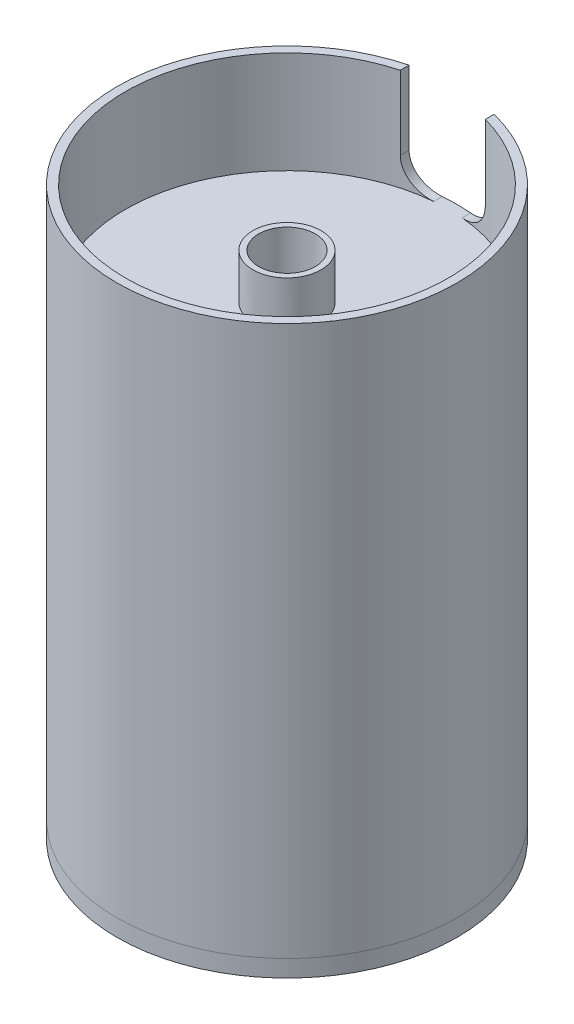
ISO-10303-21;
HEADER;
FILE_DESCRIPTION(('STEP AP214'),'2;1');
FILE_NAME('part.step','',(''),(''),'','','');
FILE_SCHEMA(('AUTOMOTIVE_DESIGN { 1 0 10303 214 1 1 1 1 }'));
ENDSEC;
DATA;
#1=APPLICATION_CONTEXT('core data for automotive mechanical design processes');
#2=APPLICATION_PROTOCOL_DEFINITION('international standard','automotive_design',2000,#1);
#3=PRODUCT_CONTEXT('',#1,'mechanical');
#4=PRODUCT('Part','Part','',(#3));
#5=PRODUCT_RELATED_PRODUCT_CATEGORY('part','',(#4));
#6=PRODUCT_DEFINITION_FORMATION('','',#4);
#7=PRODUCT_DEFINITION_CONTEXT('part definition',#1,'design');
#8=PRODUCT_DEFINITION('design','',#6,#7);
#9=PRODUCT_DEFINITION_SHAPE('','',#8);
#10=(LENGTH_UNIT() NAMED_UNIT(*) SI_UNIT(.MILLI.,.METRE.));
#11=(NAMED_UNIT(*) PLANE_ANGLE_UNIT() SI_UNIT($,.RADIAN.));
#12=(NAMED_UNIT(*) SI_UNIT($,.STERADIAN.) SOLID_ANGLE_UNIT());
#13=UNCERTAINTY_MEASURE_WITH_UNIT(LENGTH_MEASURE(1.E-05),#10,'distance_accuracy_value','');
#14=(GEOMETRIC_REPRESENTATION_CONTEXT(3) GLOBAL_UNCERTAINTY_ASSIGNED_CONTEXT((#13)) GLOBAL_UNIT_ASSIGNED_CONTEXT((#10,
#11,#12)) REPRESENTATION_CONTEXT('',''));
#15=CARTESIAN_POINT('',(0.,0.,0.));
#16=DIRECTION('',(0.,0.,1.));
#17=DIRECTION('',(1.,0.,0.));
#18=AXIS2_PLACEMENT_3D('',#15,#16,#17);
#19=CARTESIAN_POINT('',(0.,-93.,0.));
#20=DIRECTION('',(0.,-1.,0.));
#21=DIRECTION('',(1.,0.,0.));
#22=AXIS2_PLACEMENT_3D('',#19,#20,#21);
#23=CYLINDRICAL_SURFACE('',#22,18.);
#24=CARTESIAN_POINT('',(0.,-93.,0.));
#25=DIRECTION('',(0.,-1.,0.));
#26=DIRECTION('',(1.,0.,0.));
#27=AXIS2_PLACEMENT_3D('',#24,#25,#26);
#28=CIRCLE('',#27,18.);
#29=CARTESIAN_POINT('',(18.0000000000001,-93.,0.));
#30=VERTEX_POINT('',#29);
#31=EDGE_CURVE('E11',#30,#30,#28,.T.);
#32=ORIENTED_EDGE('',*,*,#31,.T.);
#33=EDGE_LOOP('',(#32));
#34=FACE_BOUND('',#33,.T.);
#35=CARTESIAN_POINT('',(1.00723583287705E-13,-94.,0.));
#36=DIRECTION('',(0.,-1.,0.));
#37=DIRECTION('',(1.,0.,0.));
#38=AXIS2_PLACEMENT_3D('',#35,#36,#37);
#39=CIRCLE('',#38,18.);
#40=CARTESIAN_POINT('',(18.0000000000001,-94.,0.));
#41=VERTEX_POINT('',#40);
#42=EDGE_CURVE('E46',#41,#41,#39,.T.);
#43=ORIENTED_EDGE('',*,*,#42,.F.);
#44=EDGE_LOOP('',(#43));
#45=FACE_BOUND('',#44,.T.);
#46=ADVANCED_FACE('F43',(#34,#45),#23,.T.);
#47=CARTESIAN_POINT('',(0.,-93.,0.));
#48=DIRECTION('',(0.,-1.,0.));
#49=DIRECTION('',(1.,0.,0.));
#50=AXIS2_PLACEMENT_3D('',#47,#48,#49);
#51=PLANE('',#50);
#52=ORIENTED_EDGE('',*,*,#31,.F.);
#53=EDGE_LOOP('',(#52));
#54=FACE_BOUND('',#53,.T.);
#55=ADVANCED_FACE('F58',(#54),#51,.F.);
#56=CARTESIAN_POINT('',(1.00723583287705E-13,-94.,0.));
#57=DIRECTION('',(0.,-1.,0.));
#58=DIRECTION('',(1.,0.,0.));
#59=AXIS2_PLACEMENT_3D('',#56,#57,#58);
#60=PLANE('',#59);
#61=ORIENTED_EDGE('',*,*,#42,.T.);
#62=EDGE_LOOP('',(#61));
#63=FACE_BOUND('',#62,.T.);
#64=ADVANCED_FACE('F55',(#63),#60,.T.);
#65=CLOSED_SHELL('',(#46,#55,#64));
#66=MANIFOLD_SOLID_BREP('B2',#65);
#67=CARTESIAN_POINT('',(0.,-91.,0.));
#68=DIRECTION('',(0.,1.,0.));
#69=DIRECTION('',(-1.,0.,0.));
#70=AXIS2_PLACEMENT_3D('',#67,#68,#69);
#71=PLANE('',#70);
#72=CARTESIAN_POINT('',(0.,-91.,0.));
#73=DIRECTION('',(0.,1.,0.));
#74=DIRECTION('',(-1.,0.,0.));
#75=AXIS2_PLACEMENT_3D('',#72,#73,#74);
#76=CIRCLE('',#75,25.);
#77=CARTESIAN_POINT('',(-24.9999999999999,-91.,0.));
#78=VERTEX_POINT('',#77);
#79=EDGE_CURVE('E42',#78,#78,#76,.T.);
#80=ORIENTED_EDGE('',*,*,#79,.T.);
#81=EDGE_LOOP('',(#80));
#82=FACE_BOUND('',#81,.T.);
#83=CARTESIAN_POINT('',(0.,-91.,0.));
#84=DIRECTION('',(0.,1.,0.));
#85=DIRECTION('',(-1.,0.,0.));
#86=AXIS2_PLACEMENT_3D('',#83,#84,#85);
#87=CIRCLE('',#86,18.);
#88=CARTESIAN_POINT('',(-17.9999999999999,-91.,0.));
#89=VERTEX_POINT('',#88);
#90=EDGE_CURVE('E102',#89,#89,#87,.T.);
#91=ORIENTED_EDGE('',*,*,#90,.F.);
#92=EDGE_LOOP('',(#91));
#93=FACE_BOUND('',#92,.T.);
#94=ADVANCED_FACE('F91',(#82,#93),#71,.T.);
#95=CARTESIAN_POINT('',(1.00723583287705E-13,-94.,0.));
#96=DIRECTION('',(0.,1.,0.));
#97=DIRECTION('',(-1.,0.,0.));
#98=AXIS2_PLACEMENT_3D('',#95,#96,#97);
#99=PLANE('',#98);
#100=CARTESIAN_POINT('',(1.00723583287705E-13,-94.,0.));
#101=DIRECTION('',(0.,1.,0.));
#102=DIRECTION('',(-1.,0.,0.));
#103=AXIS2_PLACEMENT_3D('',#100,#101,#102);
#104=CIRCLE('',#103,25.);
#105=CARTESIAN_POINT('',(-24.9999999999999,-94.,0.));
#106=VERTEX_POINT('',#105);
#107=EDGE_CURVE('E95',#106,#106,#104,.T.);
#108=ORIENTED_EDGE('',*,*,#107,.F.);
#109=EDGE_LOOP('',(#108));
#110=FACE_BOUND('',#109,.T.);
#111=CARTESIAN_POINT('',(1.00723583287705E-13,-94.,0.));
#112=DIRECTION('',(0.,1.,0.));
#113=DIRECTION('',(-1.,0.,0.));
#114=AXIS2_PLACEMENT_3D('',#111,#112,#113);
#115=CIRCLE('',#114,18.);
#116=CARTESIAN_POINT('',(-17.9999999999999,-94.,0.));
#117=VERTEX_POINT('',#116);
#118=EDGE_CURVE('E104',#117,#117,#115,.T.);
#119=ORIENTED_EDGE('',*,*,#118,.T.);
#120=EDGE_LOOP('',(#119));
#121=FACE_BOUND('',#120,.T.);
#122=ADVANCED_FACE('F114',(#110,#121),#99,.F.);
#123=CARTESIAN_POINT('',(0.,-91.,0.));
#124=DIRECTION('',(0.,-1.,0.));
#125=DIRECTION('',(1.,0.,0.));
#126=AXIS2_PLACEMENT_3D('',#123,#124,#125);
#127=CYLINDRICAL_SURFACE('',#126,25.);
#128=ORIENTED_EDGE('',*,*,#79,.F.);
#129=EDGE_LOOP('',(#128));
#130=FACE_BOUND('',#129,.T.);
#131=ORIENTED_EDGE('',*,*,#107,.T.);
#132=EDGE_LOOP('',(#131));
#133=FACE_BOUND('',#132,.T.);
#134=ADVANCED_FACE('F93',(#130,#133),#127,.T.);
#135=CARTESIAN_POINT('',(0.,-91.,0.));
#136=DIRECTION('',(0.,-1.,0.));
#137=DIRECTION('',(1.,0.,0.));
#138=AXIS2_PLACEMENT_3D('',#135,#136,#137);
#139=CYLINDRICAL_SURFACE('',#138,18.);
#140=ORIENTED_EDGE('',*,*,#90,.T.);
#141=EDGE_LOOP('',(#140));
#142=FACE_BOUND('',#141,.T.);
#143=ORIENTED_EDGE('',*,*,#118,.F.);
#144=EDGE_LOOP('',(#143));
#145=FACE_BOUND('',#144,.T.);
#146=ADVANCED_FACE('F110',(#142,#145),#139,.F.);
#147=CLOSED_SHELL('',(#94,#122,#134,#146));
#148=MANIFOLD_SOLID_BREP('B6',#147);
#149=CARTESIAN_POINT('',(0.,-94.,0.));
#150=DIRECTION('',(0.,1.,0.));
#151=DIRECTION('',(-1.,0.,0.));
#152=AXIS2_PLACEMENT_3D('',#149,#150,#151);
#153=PLANE('',#152);
#154=CARTESIAN_POINT('',(0.,-94.,0.));
#155=DIRECTION('',(0.,1.,0.));
#156=DIRECTION('',(-1.,0.,0.));
#157=AXIS2_PLACEMENT_3D('',#154,#155,#156);
#158=CIRCLE('',#157,28.535323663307);
#159=CARTESIAN_POINT('',(-28.535323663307,-94.,0.));
#160=VERTEX_POINT('',#159);
#161=EDGE_CURVE('E90',#160,#160,#158,.T.);
#162=ORIENTED_EDGE('',*,*,#161,.T.);
#163=EDGE_LOOP('',(#162));
#164=FACE_BOUND('',#163,.T.);
#165=CARTESIAN_POINT('',(0.,-94.,0.));
#166=DIRECTION('',(0.,1.,0.));
#167=DIRECTION('',(-1.,0.,0.));
#168=AXIS2_PLACEMENT_3D('',#165,#166,#167);
#169=CIRCLE('',#168,20.);
#170=CARTESIAN_POINT('',(-20.,-94.,0.));
#171=VERTEX_POINT('',#170);
#172=EDGE_CURVE('E183',#171,#171,#169,.T.);
#173=ORIENTED_EDGE('',*,*,#172,.F.);
#174=EDGE_LOOP('',(#173));
#175=FACE_BOUND('',#174,.T.);
#176=ADVANCED_FACE('F161',(#164,#175),#153,.T.);
#177=CARTESIAN_POINT('',(0.,-89.1404723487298,0.));
#178=DIRECTION('',(0.,1.,0.));
#179=DIRECTION('',(-1.,0.,0.));
#180=AXIS2_PLACEMENT_3D('',#177,#178,#179);
#181=CYLINDRICAL_SURFACE('',#180,28.535323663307);
#182=CARTESIAN_POINT('',(0.,-97.,0.));
#183=DIRECTION('',(0.,1.,0.));
#184=DIRECTION('',(-1.,0.,0.));
#185=AXIS2_PLACEMENT_3D('',#182,#183,#184);
#186=CIRCLE('',#185,28.535323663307);
#187=CARTESIAN_POINT('',(-28.535323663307,-97.,0.));
#188=VERTEX_POINT('',#187);
#189=EDGE_CURVE('E167',#188,#188,#186,.T.);
#190=ORIENTED_EDGE('',*,*,#189,.T.);
#191=EDGE_LOOP('',(#190));
#192=FACE_BOUND('',#191,.T.);
#193=ORIENTED_EDGE('',*,*,#161,.F.);
#194=EDGE_LOOP('',(#193));
#195=FACE_BOUND('',#194,.T.);
#196=ADVANCED_FACE('F191',(#192,#195),#181,.T.);
#197=CARTESIAN_POINT('',(0.,-97.,0.));
#198=DIRECTION('',(0.,1.,0.));
#199=DIRECTION('',(-1.,0.,0.));
#200=AXIS2_PLACEMENT_3D('',#197,#198,#199);
#201=PLANE('',#200);
#202=CARTESIAN_POINT('',(0.,-97.,0.));
#203=DIRECTION('',(0.,1.,0.));
#204=DIRECTION('',(-1.,0.,0.));
#205=AXIS2_PLACEMENT_3D('',#202,#203,#204);
#206=CIRCLE('',#205,30.);
#207=CARTESIAN_POINT('',(-30.,-97.,0.));
#208=VERTEX_POINT('',#207);
#209=EDGE_CURVE('E171',#208,#208,#206,.T.);
#210=ORIENTED_EDGE('',*,*,#209,.T.);
#211=EDGE_LOOP('',(#210));
#212=FACE_BOUND('',#211,.T.);
#213=ORIENTED_EDGE('',*,*,#189,.F.);
#214=EDGE_LOOP('',(#213));
#215=FACE_BOUND('',#214,.T.);
#216=ADVANCED_FACE('F195',(#212,#215),#201,.T.);
#217=CARTESIAN_POINT('',(0.,-89.1404723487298,0.));
#218=DIRECTION('',(0.,1.,0.));
#219=DIRECTION('',(-1.,0.,0.));
#220=AXIS2_PLACEMENT_3D('',#217,#218,#219);
#221=CYLINDRICAL_SURFACE('',#220,30.);
#222=ORIENTED_EDGE('',*,*,#209,.F.);
#223=EDGE_LOOP('',(#222));
#224=FACE_BOUND('',#223,.T.);
#225=CARTESIAN_POINT('',(0.,-100.,0.));
#226=DIRECTION('',(0.,1.,0.));
#227=DIRECTION('',(-1.,0.,0.));
#228=AXIS2_PLACEMENT_3D('',#225,#226,#227);
#229=CIRCLE('',#228,30.);
#230=CARTESIAN_POINT('',(-30.,-100.,0.));
#231=VERTEX_POINT('',#230);
#232=EDGE_CURVE('E175',#231,#231,#229,.T.);
#233=ORIENTED_EDGE('',*,*,#232,.T.);
#234=EDGE_LOOP('',(#233));
#235=FACE_BOUND('',#234,.T.);
#236=ADVANCED_FACE('F199',(#224,#235),#221,.T.);
#237=CARTESIAN_POINT('',(0.,-100.,0.));
#238=DIRECTION('',(0.,1.,0.));
#239=DIRECTION('',(-1.,0.,0.));
#240=AXIS2_PLACEMENT_3D('',#237,#238,#239);
#241=PLANE('',#240);
#242=ORIENTED_EDGE('',*,*,#232,.F.);
#243=EDGE_LOOP('',(#242));
#244=FACE_BOUND('',#243,.T.);
#245=CARTESIAN_POINT('',(0.,-100.,0.));
#246=DIRECTION('',(0.,1.,0.));
#247=DIRECTION('',(-1.,0.,0.));
#248=AXIS2_PLACEMENT_3D('',#245,#246,#247);
#249=CIRCLE('',#248,26.);
#250=CARTESIAN_POINT('',(-26.,-100.,0.));
#251=VERTEX_POINT('',#250);
#252=EDGE_CURVE('E180',#251,#251,#249,.T.);
#253=ORIENTED_EDGE('',*,*,#252,.T.);
#254=EDGE_LOOP('',(#253));
#255=FACE_BOUND('',#254,.T.);
#256=ADVANCED_FACE('F206',(#244,#255),#241,.F.);
#257=CARTESIAN_POINT('',(0.,-100.,0.));
#258=DIRECTION('',(0.,-1.,0.));
#259=DIRECTION('',(1.,0.,0.));
#260=AXIS2_PLACEMENT_3D('',#257,#258,#259);
#261=CONICAL_SURFACE('',#260,26.,0.785398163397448);
#262=ORIENTED_EDGE('',*,*,#172,.T.);
#263=EDGE_LOOP('',(#262));
#264=FACE_BOUND('',#263,.T.);
#265=ORIENTED_EDGE('',*,*,#252,.F.);
#266=EDGE_LOOP('',(#265));
#267=FACE_BOUND('',#266,.T.);
#268=ADVANCED_FACE('F187',(#264,#267),#261,.F.);
#269=CLOSED_SHELL('',(#176,#196,#216,#236,#256,#268));
#270=MANIFOLD_SOLID_BREP('B37',#269);
#271=CARTESIAN_POINT('',(0.,-97.,0.));
#272=DIRECTION('',(0.,1.,0.));
#273=DIRECTION('',(0.,0.,1.));
#274=AXIS2_PLACEMENT_3D('',#271,#272,#273);
#275=CYLINDRICAL_SURFACE('',#274,28.5);
#276=CARTESIAN_POINT('',(0.,-97.,0.));
#277=DIRECTION('',(0.,1.,0.));
#278=DIRECTION('',(0.,0.,1.));
#279=AXIS2_PLACEMENT_3D('',#276,#277,#278);
#280=CIRCLE('',#279,28.5);
#281=CARTESIAN_POINT('',(0.,-97.,28.5));
#282=VERTEX_POINT('',#281);
#283=EDGE_CURVE('E414',#282,#282,#280,.T.);
#284=CARTESIAN_POINT('',(0.,-21.,0.));
#285=DIRECTION('',(0.,1.,0.));
#286=DIRECTION('',(0.,0.,1.));
#287=AXIS2_PLACEMENT_3D('',#284,#285,#286);
#288=CIRCLE('',#287,28.5);
#289=CARTESIAN_POINT('',(0.,-21.,28.5));
#290=VERTEX_POINT('',#289);
#291=EDGE_CURVE('E265',#290,#290,#288,.F.);
#292=CARTESIAN_POINT('',(0.,-97.,28.5));
#293=CARTESIAN_POINT('',(0.,-96.2083333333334,28.5));
#294=CARTESIAN_POINT('',(0.,-95.4166666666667,28.5));
#295=CARTESIAN_POINT('',(0.,-93.8333333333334,28.5));
#296=CARTESIAN_POINT('',(0.,-93.0416666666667,28.5));
#297=CARTESIAN_POINT('',(0.,-91.4583333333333,28.5));
#298=CARTESIAN_POINT('',(0.,-90.6666666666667,28.5));
#299=CARTESIAN_POINT('',(0.,-89.0833333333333,28.5));
#300=CARTESIAN_POINT('',(0.,-88.2916666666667,28.5));
#301=CARTESIAN_POINT('',(0.,-86.7083333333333,28.5));
#302=CARTESIAN_POINT('',(0.,-85.9166666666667,28.5));
#303=CARTESIAN_POINT('',(0.,-84.3333333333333,28.5));
#304=CARTESIAN_POINT('',(0.,-83.5416666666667,28.5));
#305=CARTESIAN_POINT('',(0.,-81.9583333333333,28.5));
#306=CARTESIAN_POINT('',(0.,-81.1666666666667,28.5));
#307=CARTESIAN_POINT('',(0.,-79.5833333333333,28.5));
#308=CARTESIAN_POINT('',(0.,-78.7916666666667,28.5));
#309=CARTESIAN_POINT('',(0.,-77.2083333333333,28.5));
#310=CARTESIAN_POINT('',(0.,-76.4166666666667,28.5));
#311=CARTESIAN_POINT('',(0.,-74.8333333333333,28.5));
#312=CARTESIAN_POINT('',(0.,-74.0416666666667,28.5));
#313=CARTESIAN_POINT('',(0.,-72.4583333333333,28.5));
#314=CARTESIAN_POINT('',(0.,-71.6666666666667,28.5));
#315=CARTESIAN_POINT('',(0.,-70.0833333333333,28.5));
#316=CARTESIAN_POINT('',(0.,-69.2916666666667,28.5));
#317=CARTESIAN_POINT('',(0.,-67.7083333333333,28.5));
#318=CARTESIAN_POINT('',(0.,-66.9166666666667,28.5));
#319=CARTESIAN_POINT('',(0.,-65.3333333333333,28.5));
#320=CARTESIAN_POINT('',(0.,-64.5416666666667,28.5));
#321=CARTESIAN_POINT('',(0.,-62.9583333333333,28.5));
#322=CARTESIAN_POINT('',(0.,-62.1666666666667,28.5));
#323=CARTESIAN_POINT('',(0.,-60.5833333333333,28.5));
#324=CARTESIAN_POINT('',(0.,-59.7916666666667,28.5));
#325=CARTESIAN_POINT('',(0.,-58.2083333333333,28.5));
#326=CARTESIAN_POINT('',(0.,-57.4166666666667,28.5));
#327=CARTESIAN_POINT('',(0.,-55.8333333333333,28.5));
#328=CARTESIAN_POINT('',(0.,-55.0416666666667,28.5));
#329=CARTESIAN_POINT('',(0.,-53.4583333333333,28.5));
#330=CARTESIAN_POINT('',(0.,-52.6666666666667,28.5));
#331=CARTESIAN_POINT('',(0.,-51.0833333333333,28.5));
#332=CARTESIAN_POINT('',(0.,-50.2916666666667,28.5));
#333=CARTESIAN_POINT('',(0.,-48.7083333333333,28.5));
#334=CARTESIAN_POINT('',(0.,-47.9166666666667,28.5));
#335=CARTESIAN_POINT('',(0.,-46.3333333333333,28.5));
#336=CARTESIAN_POINT('',(0.,-45.5416666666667,28.5));
#337=CARTESIAN_POINT('',(0.,-43.9583333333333,28.5));
#338=CARTESIAN_POINT('',(0.,-43.1666666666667,28.5));
#339=CARTESIAN_POINT('',(0.,-41.5833333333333,28.5));
#340=CARTESIAN_POINT('',(0.,-40.7916666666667,28.5));
#341=CARTESIAN_POINT('',(0.,-39.2083333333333,28.5));
#342=CARTESIAN_POINT('',(0.,-38.4166666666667,28.5));
#343=CARTESIAN_POINT('',(0.,-36.8333333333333,28.5));
#344=CARTESIAN_POINT('',(0.,-36.0416666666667,28.5));
#345=CARTESIAN_POINT('',(0.,-34.4583333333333,28.5));
#346=CARTESIAN_POINT('',(0.,-33.6666666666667,28.5));
#347=CARTESIAN_POINT('',(0.,-32.0833333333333,28.5));
#348=CARTESIAN_POINT('',(0.,-31.2916666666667,28.5));
#349=CARTESIAN_POINT('',(0.,-29.7083333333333,28.5));
#350=CARTESIAN_POINT('',(0.,-28.9166666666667,28.5));
#351=CARTESIAN_POINT('',(0.,-27.3333333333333,28.5));
#352=CARTESIAN_POINT('',(0.,-26.5416666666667,28.5));
#353=CARTESIAN_POINT('',(0.,-24.9583333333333,28.5));
#354=CARTESIAN_POINT('',(0.,-24.1666666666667,28.5));
#355=CARTESIAN_POINT('',(0.,-22.5833333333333,28.5));
#356=CARTESIAN_POINT('',(0.,-21.7916666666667,28.5));
#357=CARTESIAN_POINT('',(0.,-21.,28.5));
#358=B_SPLINE_CURVE_WITH_KNOTS('',3,(#292,#293,#294,#295,#296,#297,#298,#299,#300,#301,#302,
#303,#304,#305,#306,#307,#308,#309,#310,#311,#312,#313,#314,#315,#316,#317,#318,#319,#320,#321,
#322,#323,#324,#325,#326,#327,#328,#329,#330,#331,#332,#333,#334,#335,#336,#337,#338,#339,#340,
#341,#342,#343,#344,#345,#346,#347,#348,#349,#350,#351,#352,#353,#354,#355,#356,#357),
.UNSPECIFIED.,.F.,.F.,(4,2,2,2,2,2,2,2,2,2,2,2,2,2,2,2,2,2,2,2,2,2,2,2,2,2,2,2,2,2,2,2,4),(0.,
2.375,4.75,7.12500000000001,9.50000000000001,11.875,14.25,16.625,19.,21.375,23.75,26.125,28.5,
30.875,33.25,35.625,38.,40.375,42.75,45.125,47.5,49.875,52.25,54.625,57.,59.375,61.75,64.125,
66.5,68.875,71.25,73.625,76.),.UNSPECIFIED.);
#359=EDGE_CURVE('BSEAM256',#282,#290,#358,.T.);
#360=ORIENTED_EDGE('',*,*,#283,.F.);
#361=ORIENTED_EDGE('',*,*,#291,.F.);
#362=ORIENTED_EDGE('',*,*,#359,.T.);
#363=ORIENTED_EDGE('',*,*,#359,.F.);
#364=EDGE_LOOP('',(#360,#362,#361,#363));
#365=FACE_BOUND('',#364,.T.);
#366=ADVANCED_FACE('F256',(#365),#275,.F.);
#367=CARTESIAN_POINT('',(7.5,-13.,-40.));
#368=DIRECTION('',(1.,0.,0.));
#369=DIRECTION('',(0.,1.,0.));
#370=AXIS2_PLACEMENT_3D('',#367,#368,#369);
#371=PLANE('',#370);
#372=DIRECTION('',(0.,1.,0.));
#373=VECTOR('',#372,1.);
#374=CARTESIAN_POINT('',(7.50000000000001,-97.,-27.495454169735));
#375=LINE('',#374,#373);
#376=CARTESIAN_POINT('',(7.5,0.,-27.495454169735));
#377=VERTEX_POINT('',#376);
#378=CARTESIAN_POINT('',(7.5,-13.,-27.495454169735));
#379=VERTEX_POINT('',#378);
#380=EDGE_CURVE('E353',#377,#379,#375,.F.);
#381=ORIENTED_EDGE('',*,*,#380,.F.);
#382=DIRECTION('',(0.,0.,-1.));
#383=VECTOR('',#382,1.);
#384=CARTESIAN_POINT('',(7.5,0.,0.));
#385=LINE('',#384,#383);
#386=CARTESIAN_POINT('',(7.5,0.,-29.0473750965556));
#387=VERTEX_POINT('',#386);
#388=EDGE_CURVE('E355',#377,#387,#385,.T.);
#389=ORIENTED_EDGE('',*,*,#388,.T.);
#390=DIRECTION('',(0.,1.,0.));
#391=VECTOR('',#390,1.);
#392=CARTESIAN_POINT('',(7.50000000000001,-97.,-29.0473750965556));
#393=LINE('',#392,#391);
#394=CARTESIAN_POINT('',(7.5,-13.,-29.0473750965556));
#395=VERTEX_POINT('',#394);
#396=EDGE_CURVE('E357',#387,#395,#393,.F.);
#397=ORIENTED_EDGE('',*,*,#396,.T.);
#398=DIRECTION('',(0.,0.,1.));
#399=VECTOR('',#398,1.);
#400=CARTESIAN_POINT('',(7.5,-13.,-40.));
#401=LINE('',#400,#399);
#402=EDGE_CURVE('E341',#395,#379,#401,.T.);
#403=ORIENTED_EDGE('',*,*,#402,.T.);
#404=EDGE_LOOP('',(#381,#389,#397,#403));
#405=FACE_BOUND('',#404,.T.);
#406=ADVANCED_FACE('F394',(#405),#371,.F.);
#407=CARTESIAN_POINT('',(-7.5,-13.,-40.));
#408=DIRECTION('',(-1.,0.,0.));
#409=DIRECTION('',(0.,-1.,0.));
#410=AXIS2_PLACEMENT_3D('',#407,#408,#409);
#411=PLANE('',#410);
#412=DIRECTION('',(0.,0.,1.));
#413=VECTOR('',#412,1.);
#414=CARTESIAN_POINT('',(-7.5,0.,0.));
#415=LINE('',#414,#413);
#416=CARTESIAN_POINT('',(-7.5,0.,-29.0473750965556));
#417=VERTEX_POINT('',#416);
#418=CARTESIAN_POINT('',(-7.5,0.,-27.495454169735));
#419=VERTEX_POINT('',#418);
#420=EDGE_CURVE('E348',#417,#419,#415,.T.);
#421=ORIENTED_EDGE('',*,*,#420,.T.);
#422=DIRECTION('',(0.,1.,0.));
#423=VECTOR('',#422,1.);
#424=CARTESIAN_POINT('',(-7.49999999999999,-97.,-27.495454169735));
#425=LINE('',#424,#423);
#426=CARTESIAN_POINT('',(-7.5,-13.,-27.495454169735));
#427=VERTEX_POINT('',#426);
#428=EDGE_CURVE('E344',#427,#419,#425,.T.);
#429=ORIENTED_EDGE('',*,*,#428,.F.);
#430=DIRECTION('',(0.,0.,1.));
#431=VECTOR('',#430,1.);
#432=CARTESIAN_POINT('',(-7.5,-13.,-40.));
#433=LINE('',#432,#431);
#434=CARTESIAN_POINT('',(-7.5,-13.,-29.0473750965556));
#435=VERTEX_POINT('',#434);
#436=EDGE_CURVE('E318',#435,#427,#433,.T.);
#437=ORIENTED_EDGE('',*,*,#436,.F.);
#438=DIRECTION('',(0.,1.,0.));
#439=VECTOR('',#438,1.);
#440=CARTESIAN_POINT('',(-7.49999999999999,-97.,-29.0473750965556));
#441=LINE('',#440,#439);
#442=EDGE_CURVE('E351',#435,#417,#441,.T.);
#443=ORIENTED_EDGE('',*,*,#442,.T.);
#444=EDGE_LOOP('',(#421,#429,#437,#443));
#445=FACE_BOUND('',#444,.T.);
#446=ADVANCED_FACE('F373',(#445),#411,.F.);
#447=CARTESIAN_POINT('',(0.,-97.,0.));
#448=DIRECTION('',(0.,1.,0.));
#449=DIRECTION('',(0.,0.,1.));
#450=AXIS2_PLACEMENT_3D('',#447,#448,#449);
#451=CYLINDRICAL_SURFACE('',#450,30.);
#452=ORIENTED_EDGE('',*,*,#396,.F.);
#453=CARTESIAN_POINT('',(0.,0.,0.));
#454=DIRECTION('',(0.,1.,0.));
#455=DIRECTION('',(0.,0.,1.));
#456=AXIS2_PLACEMENT_3D('',#453,#454,#455);
#457=CIRCLE('',#456,30.);
#458=EDGE_CURVE('E383',#417,#387,#457,.T.);
#459=ORIENTED_EDGE('',*,*,#458,.F.);
#460=ORIENTED_EDGE('',*,*,#442,.F.);
#461=CARTESIAN_POINT('',(-2.49999999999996,-18.,-29.8956518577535));
#462=CARTESIAN_POINT('',(-2.64118808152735,-18.0000157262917,-29.8838552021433));
#463=CARTESIAN_POINT('',(-2.78228362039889,-17.9940205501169,-29.871039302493));
#464=CARTESIAN_POINT('',(-3.06326341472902,-17.9701678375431,-29.8435282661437));
#465=CARTESIAN_POINT('',(-3.20314784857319,-17.9523120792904,-29.8288334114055));
#466=CARTESIAN_POINT('',(-3.48052278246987,-17.9049316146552,-29.7977424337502));
#467=CARTESIAN_POINT('',(-3.61801643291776,-17.8754237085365,-29.7813487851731));
#468=CARTESIAN_POINT('',(-3.88985915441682,-17.8049977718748,-29.7470629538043));
#469=CARTESIAN_POINT('',(-4.02420817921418,-17.7640795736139,-29.7291707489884));
#470=CARTESIAN_POINT('',(-4.28881186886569,-17.6711680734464,-29.6921528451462));
#471=CARTESIAN_POINT('',(-4.41906737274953,-17.619177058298,-29.6730274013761));
#472=CARTESIAN_POINT('',(-4.67468416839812,-17.504484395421,-29.6338329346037));
#473=CARTESIAN_POINT('',(-4.80004363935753,-17.4417788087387,-29.6137635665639));
#474=CARTESIAN_POINT('',(-5.0449560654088,-17.3061339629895,-29.5730253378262));
#475=CARTESIAN_POINT('',(-5.16451035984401,-17.2331970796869,-29.5523566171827));
#476=CARTESIAN_POINT('',(-5.39709431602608,-17.0775521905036,-29.5107664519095));
#477=CARTESIAN_POINT('',(-5.51012167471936,-16.9948407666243,-29.4898449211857));
#478=CARTESIAN_POINT('',(-5.73019776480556,-16.8191477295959,-29.447878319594));
#479=CARTESIAN_POINT('',(-5.83715634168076,-16.7260527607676,-29.4268348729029));
#480=CARTESIAN_POINT('',(-6.04283725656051,-16.531060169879,-29.3852876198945));
#481=CARTESIAN_POINT('',(-6.14155961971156,-16.4291625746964,-29.3647838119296));
#482=CARTESIAN_POINT('',(-6.33010732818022,-16.2172043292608,-29.3247171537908));
#483=CARTESIAN_POINT('',(-6.4199295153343,-16.1071408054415,-29.3051546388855));
#484=CARTESIAN_POINT('',(-6.5899523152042,-15.8796607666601,-29.267389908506));
#485=CARTESIAN_POINT('',(-6.67015647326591,-15.7622469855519,-29.2491871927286));
#486=CARTESIAN_POINT('',(-6.8202704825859,-15.5209954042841,-29.2145484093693));
#487=CARTESIAN_POINT('',(-6.89019461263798,-15.3971668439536,-29.1981099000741));
#488=CARTESIAN_POINT('',(-7.01930706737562,-15.1438440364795,-29.1673401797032));
#489=CARTESIAN_POINT('',(-7.07849962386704,-15.0143520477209,-29.1530081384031));
#490=CARTESIAN_POINT('',(-7.18566790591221,-14.750644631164,-29.1267784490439));
#491=CARTESIAN_POINT('',(-7.23364979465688,-14.6164318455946,-29.1148794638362));
#492=CARTESIAN_POINT('',(-7.31801473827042,-14.3442614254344,-29.0937887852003));
#493=CARTESIAN_POINT('',(-7.35440113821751,-14.2063048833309,-29.0845963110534));
#494=CARTESIAN_POINT('',(-7.42305574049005,-13.8919444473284,-29.0671607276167));
#495=CARTESIAN_POINT('',(-7.45189602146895,-13.7147236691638,-29.0597603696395));
#496=CARTESIAN_POINT('',(-7.48074845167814,-13.447422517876,-29.0523404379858));
#497=CARTESIAN_POINT('',(-7.48796458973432,-13.3581058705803,-29.050480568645));
#498=CARTESIAN_POINT('',(-7.49759009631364,-13.1792000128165,-29.0479974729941));
#499=CARTESIAN_POINT('',(-7.49999963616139,-13.0896108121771,-29.0473742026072));
#500=CARTESIAN_POINT('',(-7.5,-13.,-29.0473750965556));
#501=B_SPLINE_CURVE_WITH_KNOTS('',3,(#461,#462,#463,#464,#465,#466,#467,#468,#469,#470,#471,
#472,#473,#474,#475,#476,#477,#478,#479,#480,#481,#482,#483,#484,#485,#486,#487,#488,#489,#490,
#491,#492,#493,#494,#495,#496,#497,#498,#499,#500),.UNSPECIFIED.,.F.,.F.,(4,2,2,2,2,2,2,2,2,2,2,
2,2,2,2,2,2,2,2,4),(0.,0.424899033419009,0.849734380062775,1.27395941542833,1.69819068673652,
2.1223344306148,2.54663443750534,2.97083608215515,3.39518650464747,3.82473304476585,
4.25427827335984,4.6839753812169,5.11351360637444,5.54244945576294,5.97121579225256,
6.39974585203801,6.82815217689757,7.36602402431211,7.63478848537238,7.90354336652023),.UNSPECIFIED.);
#502=CARTESIAN_POINT('',(-2.49999999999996,-18.,-29.8956518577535));
#503=VERTEX_POINT('',#502);
#504=EDGE_CURVE('E359',#503,#435,#501,.T.);
#505=ORIENTED_EDGE('',*,*,#504,.F.);
#506=CARTESIAN_POINT('',(0.,-18.,0.));
#507=DIRECTION('',(0.,-1.,0.));
#508=DIRECTION('',(0.,0.,-1.));
#509=AXIS2_PLACEMENT_3D('',#506,#507,#508);
#510=CIRCLE('',#509,30.);
#511=CARTESIAN_POINT('',(2.49999999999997,-18.,-29.8956518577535));
#512=VERTEX_POINT('',#511);
#513=EDGE_CURVE('E315',#512,#503,#510,.F.);
#514=ORIENTED_EDGE('',*,*,#513,.F.);
#515=CARTESIAN_POINT('',(7.5,-13.,-29.0473750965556));
#516=CARTESIAN_POINT('',(7.50001747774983,-13.1380037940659,-29.0473630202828));
#517=CARTESIAN_POINT('',(7.49428725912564,-13.2760026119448,-29.0488498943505));
#518=CARTESIAN_POINT('',(7.47145953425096,-13.5509743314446,-29.054733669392));
#519=CARTESIAN_POINT('',(7.45436373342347,-13.6879473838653,-29.0591301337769));
#520=CARTESIAN_POINT('',(7.40897661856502,-13.9596317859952,-29.0707340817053));
#521=CARTESIAN_POINT('',(7.38070692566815,-14.0943469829,-29.0779361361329));
#522=CARTESIAN_POINT('',(7.31321338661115,-14.3608330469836,-29.094984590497));
#523=CARTESIAN_POINT('',(7.2739894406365,-14.4926038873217,-29.1048310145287));
#524=CARTESIAN_POINT('',(7.18491444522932,-14.7522593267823,-29.126948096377));
#525=CARTESIAN_POINT('',(7.13506570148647,-14.8801447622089,-29.139218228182));
#526=CARTESIAN_POINT('',(7.0251063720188,-15.1312449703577,-29.1659232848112));
#527=CARTESIAN_POINT('',(6.96499198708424,-15.2544579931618,-29.1803590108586));
#528=CARTESIAN_POINT('',(6.83497776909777,-15.4953348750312,-29.2110858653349));
#529=CARTESIAN_POINT('',(6.76507968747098,-15.6129997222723,-29.2273766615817));
#530=CARTESIAN_POINT('',(6.61596629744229,-15.8420958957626,-29.261490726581));
#531=CARTESIAN_POINT('',(6.53674749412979,-15.9535248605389,-29.2793145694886));
#532=CARTESIAN_POINT('',(6.36806622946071,-16.1713364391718,-29.316468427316));
#533=CARTESIAN_POINT('',(6.27844596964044,-16.2775932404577,-29.3358196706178));
#534=CARTESIAN_POINT('',(6.09072749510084,-16.4822353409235,-29.3753679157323));
#535=CARTESIAN_POINT('',(5.99262613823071,-16.5806176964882,-29.3955652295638));
#536=CARTESIAN_POINT('',(5.78864403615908,-16.7688295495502,-29.4364130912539));
#537=CARTESIAN_POINT('',(5.68276413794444,-16.8586599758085,-29.4570635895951));
#538=CARTESIAN_POINT('',(5.46387421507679,-17.0292318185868,-29.4984489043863));
#539=CARTESIAN_POINT('',(5.35086163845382,-17.1099699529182,-29.5191837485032));
#540=CARTESIAN_POINT('',(5.11591324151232,-17.2634631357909,-29.5608181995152));
#541=CARTESIAN_POINT('',(4.99383569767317,-17.3360031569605,-29.5817113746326));
#542=CARTESIAN_POINT('',(4.7438672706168,-17.4704814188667,-29.6228251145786));
#543=CARTESIAN_POINT('',(4.61597635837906,-17.5324196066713,-29.6430456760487));
#544=CARTESIAN_POINT('',(4.35531801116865,-17.6452065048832,-29.6824621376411));
#545=CARTESIAN_POINT('',(4.22255326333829,-17.6960612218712,-29.7016585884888));
#546=CARTESIAN_POINT('',(3.95306078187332,-17.7863158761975,-29.7387261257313));
#547=CARTESIAN_POINT('',(3.81633386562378,-17.8257181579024,-29.7565974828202));
#548=CARTESIAN_POINT('',(3.48570631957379,-17.9058629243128,-29.7974377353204));
#549=CARTESIAN_POINT('',(3.29033793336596,-17.9411149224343,-29.8196703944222));
#550=CARTESIAN_POINT('',(2.9951160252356,-17.9764145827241,-29.8502782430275));
#551=CARTESIAN_POINT('',(2.89636719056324,-17.9852514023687,-29.8600223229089));
#552=CARTESIAN_POINT('',(2.6984360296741,-17.9970433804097,-29.878559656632));
#553=CARTESIAN_POINT('',(2.59925372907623,-17.9999988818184,-29.8873529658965));
#554=CARTESIAN_POINT('',(2.49999999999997,-18.,-29.8956518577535));
#555=B_SPLINE_CURVE_WITH_KNOTS('',3,(#515,#516,#517,#518,#519,#520,#521,#522,#523,#524,#525,
#526,#527,#528,#529,#530,#531,#532,#533,#534,#535,#536,#537,#538,#539,#540,#541,#542,#543,#544,
#545,#546,#547,#548,#549,#550,#551,#552,#553,#554),.UNSPECIFIED.,.F.,.F.,(4,2,2,2,2,2,2,2,2,2,2,
2,2,2,2,2,2,2,2,4),(0.,0.413876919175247,0.827691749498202,1.24070975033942,1.65373151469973,
2.06666374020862,2.47974912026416,2.89276064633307,3.30592753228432,3.72648003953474,
4.14718902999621,4.56785227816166,4.98866689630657,5.41875118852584,5.8488376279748,
6.27869040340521,6.70845512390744,7.30612138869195,7.60483472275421,7.90353063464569),.UNSPECIFIED.);
#556=EDGE_CURVE('E277',#395,#512,#555,.T.);
#557=ORIENTED_EDGE('',*,*,#556,.F.);
#558=EDGE_LOOP('',(#452,#459,#460,#505,#514,#557));
#559=FACE_BOUND('',#558,.T.);
#560=CARTESIAN_POINT('',(0.,-97.,0.));
#561=DIRECTION('',(0.,1.,0.));
#562=DIRECTION('',(0.,0.,1.));
#563=AXIS2_PLACEMENT_3D('',#560,#561,#562);
#564=CIRCLE('',#563,30.);
#565=CARTESIAN_POINT('',(0.,-97.,30.));
#566=VERTEX_POINT('',#565);
#567=EDGE_CURVE('E327',#566,#566,#564,.T.);
#568=ORIENTED_EDGE('',*,*,#567,.T.);
#569=EDGE_LOOP('',(#568));
#570=FACE_BOUND('',#569,.T.);
#571=ADVANCED_FACE('F258',(#559,#570),#451,.T.);
#572=CARTESIAN_POINT('',(0.,-97.,0.));
#573=DIRECTION('',(0.,1.,0.));
#574=DIRECTION('',(0.,0.,1.));
#575=AXIS2_PLACEMENT_3D('',#572,#573,#574);
#576=PLANE('',#575);
#577=ORIENTED_EDGE('',*,*,#283,.T.);
#578=EDGE_LOOP('',(#577));
#579=FACE_BOUND('',#578,.T.);
#580=ORIENTED_EDGE('',*,*,#567,.F.);
#581=EDGE_LOOP('',(#580));
#582=FACE_BOUND('',#581,.T.);
#583=ADVANCED_FACE('F395',(#579,#582),#576,.F.);
#584=CARTESIAN_POINT('',(0.,0.,0.));
#585=DIRECTION('',(0.,1.,0.));
#586=DIRECTION('',(0.,0.,1.));
#587=AXIS2_PLACEMENT_3D('',#584,#585,#586);
#588=PLANE('',#587);
#589=ORIENTED_EDGE('',*,*,#388,.F.);
#590=CARTESIAN_POINT('',(0.,0.,0.));
#591=DIRECTION('',(0.,1.,0.));
#592=DIRECTION('',(0.,0.,1.));
#593=AXIS2_PLACEMENT_3D('',#590,#591,#592);
#594=CIRCLE('',#593,28.5);
#595=EDGE_CURVE('E331',#377,#419,#594,.F.);
#596=ORIENTED_EDGE('',*,*,#595,.T.);
#597=ORIENTED_EDGE('',*,*,#420,.F.);
#598=ORIENTED_EDGE('',*,*,#458,.T.);
#599=EDGE_LOOP('',(#589,#596,#597,#598));
#600=FACE_BOUND('',#599,.T.);
#601=ADVANCED_FACE('F393',(#600),#588,.T.);
#602=CARTESIAN_POINT('',(7.5,-13.,-27.495454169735));
#603=CARTESIAN_POINT('',(7.50001772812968,-13.1377167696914,-27.4954413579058));
#604=CARTESIAN_POINT('',(7.49431101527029,-13.2754282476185,-27.4970057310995));
#605=CARTESIAN_POINT('',(7.47157882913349,-13.5498230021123,-27.5031955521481));
#606=CARTESIAN_POINT('',(7.45455518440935,-13.6865064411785,-27.5078205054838));
#607=CARTESIAN_POINT('',(7.40936555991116,-13.9575943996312,-27.5200257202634));
#608=CARTESIAN_POINT('',(7.38122250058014,-14.0920030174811,-27.527599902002));
#609=CARTESIAN_POINT('',(7.3140382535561,-14.3578783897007,-27.5455270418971));
#610=CARTESIAN_POINT('',(7.27499694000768,-14.4893451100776,-27.5558800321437));
#611=CARTESIAN_POINT('',(7.18634865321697,-14.7483916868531,-27.5791313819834));
#612=CARTESIAN_POINT('',(7.13674458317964,-14.875972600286,-27.592029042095));
#613=CARTESIAN_POINT('',(7.02733682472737,-15.1264781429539,-27.6200964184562));
#614=CARTESIAN_POINT('',(6.9675293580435,-15.2494010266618,-27.6352669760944));
#615=CARTESIAN_POINT('',(6.83818887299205,-15.4897261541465,-27.6675552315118));
#616=CARTESIAN_POINT('',(6.76865722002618,-15.6071291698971,-27.6846726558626));
#617=CARTESIAN_POINT('',(6.6203368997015,-15.8357356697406,-27.7205151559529));
#618=CARTESIAN_POINT('',(6.54154475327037,-15.9469368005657,-27.7392408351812));
#619=CARTESIAN_POINT('',(6.37361494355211,-16.1645486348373,-27.7783118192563));
#620=CARTESIAN_POINT('',(6.28430291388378,-16.2708203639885,-27.7986819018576));
#621=CARTESIAN_POINT('',(6.09722205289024,-16.475518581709,-27.8403137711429));
#622=CARTESIAN_POINT('',(5.99945008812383,-16.5739421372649,-27.8615758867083));
#623=CARTESIAN_POINT('',(5.79612964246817,-16.7622759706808,-27.9045814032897));
#624=CARTESIAN_POINT('',(5.69058195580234,-16.8521871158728,-27.9263247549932));
#625=CARTESIAN_POINT('',(5.47239367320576,-17.0229466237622,-27.9699002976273));
#626=CARTESIAN_POINT('',(5.35975053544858,-17.1037917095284,-27.9917325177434));
#627=CARTESIAN_POINT('',(5.0066101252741,-17.3355871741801,-28.0578310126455));
#628=CARTESIAN_POINT('',(4.75575426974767,-17.4712923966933,-28.1016478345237));
#629=CARTESIAN_POINT('',(4.23424612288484,-17.6982166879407,-28.1849393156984));
#630=CARTESIAN_POINT('',(3.9636071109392,-17.7894652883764,-28.2244168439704));
#631=CARTESIAN_POINT('',(3.49316314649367,-17.904427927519,-28.2857909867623));
#632=CARTESIAN_POINT('',(3.29645487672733,-17.9401884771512,-28.3094096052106));
#633=CARTESIAN_POINT('',(2.89992778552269,-17.9879870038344,-28.3527897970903));
#634=CARTESIAN_POINT('',(2.70011162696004,-18.0000442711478,-28.3725544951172));
#635=CARTESIAN_POINT('',(2.49999999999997,-18.,-28.3901391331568));
#636=B_SPLINE_CURVE_WITH_KNOTS('',3,(#602,#603,#604,#605,#606,#607,#608,#609,#610,#611,#612,
#613,#614,#615,#616,#617,#618,#619,#620,#621,#622,#623,#624,#625,#626,#627,#628,#629,#630,#631,
#632,#633,#634,#635),.UNSPECIFIED.,.F.,.F.,(4,2,2,2,2,2,2,2,2,2,2,2,2,2,2,2,4),(0.,
0.413015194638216,0.825963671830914,1.23806534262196,1.65017177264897,2.06216507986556,
2.47431127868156,2.88639966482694,3.29864336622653,3.71907317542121,4.1396593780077,
4.56020268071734,4.98089750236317,5.84215431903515,6.70283823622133,7.30541676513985,
7.90750469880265),.UNSPECIFIED.);
#637=CARTESIAN_POINT('',(2.49999999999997,-18.,-28.3901391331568));
#638=VERTEX_POINT('',#637);
#639=EDGE_CURVE('E326',#379,#638,#636,.T.);
#640=ORIENTED_EDGE('',*,*,#639,.T.);
#641=CARTESIAN_POINT('',(0.,-18.,0.));
#642=DIRECTION('',(0.,1.,0.));
#643=DIRECTION('',(0.,0.,1.));
#644=AXIS2_PLACEMENT_3D('',#641,#642,#643);
#645=CIRCLE('',#644,28.5);
#646=CARTESIAN_POINT('',(-2.5,-18.,-28.3901391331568));
#647=VERTEX_POINT('',#646);
#648=EDGE_CURVE('E313',#647,#638,#645,.T.);
#649=ORIENTED_EDGE('',*,*,#648,.F.);
#650=CARTESIAN_POINT('',(-2.49999999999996,-18.,-28.3901391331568));
#651=CARTESIAN_POINT('',(-2.6412452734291,-18.0000157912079,-28.3777118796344));
#652=CARTESIAN_POINT('',(-2.78238808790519,-17.9940157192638,-28.3642105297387));
#653=CARTESIAN_POINT('',(-3.0634400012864,-17.9701488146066,-28.3352276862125));
#654=CARTESIAN_POINT('',(-3.20334929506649,-17.9522838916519,-28.319746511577));
#655=CARTESIAN_POINT('',(-3.48074168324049,-17.9048879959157,-28.2869927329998));
#656=CARTESIAN_POINT('',(-3.61822812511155,-17.8753746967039,-28.2697228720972));
#657=CARTESIAN_POINT('',(-3.89003737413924,-17.8049457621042,-28.2336040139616));
#658=CARTESIAN_POINT('',(-4.02436012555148,-17.7640299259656,-28.2147549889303));
#659=CARTESIAN_POINT('',(-4.28888845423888,-17.6711374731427,-28.1757574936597));
#660=CARTESIAN_POINT('',(-4.41909509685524,-17.6191637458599,-28.1556093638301));
#661=CARTESIAN_POINT('',(-4.67460473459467,-17.5045209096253,-28.1143170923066));
#662=CARTESIAN_POINT('',(-4.79990590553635,-17.4418478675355,-28.0931725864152));
#663=CARTESIAN_POINT('',(-5.04470307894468,-17.3062812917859,-28.050247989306));
#664=CARTESIAN_POINT('',(-5.16420023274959,-17.2333897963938,-28.0284680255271));
#665=CARTESIAN_POINT('',(-5.39667378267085,-17.0778483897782,-27.9846370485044));
#666=CARTESIAN_POINT('',(-5.50964787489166,-16.9951950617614,-27.9625859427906));
#667=CARTESIAN_POINT('',(-5.72977937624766,-16.8195059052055,-27.9183166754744));
#668=CARTESIAN_POINT('',(-5.83683646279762,-16.7263438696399,-27.8961003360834));
#669=CARTESIAN_POINT('',(-6.04270659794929,-16.5311961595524,-27.8522310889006));
#670=CARTESIAN_POINT('',(-6.14151967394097,-16.4292105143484,-27.830578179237));
#671=CARTESIAN_POINT('',(-6.3302416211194,-16.2170503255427,-27.7882600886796));
#672=CARTESIAN_POINT('',(-6.42014732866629,-16.1068728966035,-27.7675952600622));
#673=CARTESIAN_POINT('',(-6.5903277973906,-15.8791348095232,-27.7276976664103));
#674=CARTESIAN_POINT('',(-6.67060613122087,-15.7615769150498,-27.708464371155));
#675=CARTESIAN_POINT('',(-6.8208456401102,-15.5200181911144,-27.6718636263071));
#676=CARTESIAN_POINT('',(-6.89082238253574,-15.3960274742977,-27.6544933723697));
#677=CARTESIAN_POINT('',(-7.02002276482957,-15.142346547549,-27.621978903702));
#678=CARTESIAN_POINT('',(-7.07925068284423,-15.0126586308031,-27.6068338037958));
#679=CARTESIAN_POINT('',(-7.18646321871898,-14.7485307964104,-27.5791191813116));
#680=CARTESIAN_POINT('',(-7.23445437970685,-14.6140936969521,-27.5665481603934));
#681=CARTESIAN_POINT('',(-7.31880557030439,-14.3414475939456,-27.5442731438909));
#682=CARTESIAN_POINT('',(-7.35516902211,-14.2032397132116,-27.5345683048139));
#683=CARTESIAN_POINT('',(-7.42353645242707,-13.8891686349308,-27.5162258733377));
#684=CARTESIAN_POINT('',(-7.45219509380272,-13.7125055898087,-27.508457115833));
#685=CARTESIAN_POINT('',(-7.48086739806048,-13.4460400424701,-27.5006673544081));
#686=CARTESIAN_POINT('',(-7.48803888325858,-13.3569997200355,-27.4987146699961));
#687=CARTESIAN_POINT('',(-7.49760495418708,-13.1786467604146,-27.4961076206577));
#688=CARTESIAN_POINT('',(-7.49999969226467,-13.0893341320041,-27.4954532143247));
#689=CARTESIAN_POINT('',(-7.5,-13.,-27.495454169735));
#690=B_SPLINE_CURVE_WITH_KNOTS('',3,(#650,#651,#652,#653,#654,#655,#656,#657,#658,#659,#660,
#661,#662,#663,#664,#665,#666,#667,#668,#669,#670,#671,#672,#673,#674,#675,#676,#677,#678,#679,
#680,#681,#682,#683,#684,#685,#686,#687,#688,#689),.UNSPECIFIED.,.F.,.F.,(4,2,2,2,2,2,2,2,2,2,2,
2,2,2,2,2,2,2,2,4),(0.,0.425230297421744,0.850392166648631,1.27491142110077,1.69943815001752,
2.12385408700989,2.548426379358,2.9729141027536,3.39755084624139,3.8279779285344,
4.25840358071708,4.68898156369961,5.11939926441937,5.5491597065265,5.97874872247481,
6.40808696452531,6.83729872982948,7.37348462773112,7.64141831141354,7.90934344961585),.UNSPECIFIED.);
#691=EDGE_CURVE('E322',#647,#427,#690,.T.);
#692=ORIENTED_EDGE('',*,*,#691,.T.);
#693=ORIENTED_EDGE('',*,*,#428,.T.);
#694=ORIENTED_EDGE('',*,*,#595,.F.);
#695=ORIENTED_EDGE('',*,*,#380,.T.);
#696=EDGE_LOOP('',(#640,#649,#692,#693,#694,#695));
#697=FACE_BOUND('',#696,.T.);
#698=ADVANCED_FACE('F329',(#697),#275,.F.);
#699=CARTESIAN_POINT('',(2.5,-13.,-40.));
#700=DIRECTION('',(0.,0.,1.));
#701=DIRECTION('',(1.,0.,0.));
#702=AXIS2_PLACEMENT_3D('',#699,#700,#701);
#703=CYLINDRICAL_SURFACE('',#702,5.);
#704=ORIENTED_EDGE('',*,*,#556,.T.);
#705=DIRECTION('',(0.,0.,1.));
#706=VECTOR('',#705,1.);
#707=CARTESIAN_POINT('',(2.49999999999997,-18.,-40.));
#708=LINE('',#707,#706);
#709=EDGE_CURVE('E272',#512,#638,#708,.T.);
#710=ORIENTED_EDGE('',*,*,#709,.T.);
#711=ORIENTED_EDGE('',*,*,#639,.F.);
#712=ORIENTED_EDGE('',*,*,#402,.F.);
#713=EDGE_LOOP('',(#704,#710,#711,#712));
#714=FACE_BOUND('',#713,.T.);
#715=ADVANCED_FACE('F392',(#714),#703,.F.);
#716=CARTESIAN_POINT('',(-2.49999999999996,-18.,-40.));
#717=DIRECTION('',(0.,-1.,0.));
#718=DIRECTION('',(0.,0.,-1.));
#719=AXIS2_PLACEMENT_3D('',#716,#717,#718);
#720=PLANE('',#719);
#721=CARTESIAN_POINT('',(0.,-18.,0.));
#722=DIRECTION('',(0.,-1.,0.));
#723=DIRECTION('',(0.,0.,-1.));
#724=AXIS2_PLACEMENT_3D('',#721,#722,#723);
#725=CIRCLE('',#724,6.);
#726=CARTESIAN_POINT('',(0.,-18.,-6.));
#727=VERTEX_POINT('',#726);
#728=EDGE_CURVE('E159',#727,#727,#725,.F.);
#729=ORIENTED_EDGE('',*,*,#728,.F.);
#730=EDGE_LOOP('',(#729));
#731=FACE_BOUND('',#730,.T.);
#732=ORIENTED_EDGE('',*,*,#513,.T.);
#733=DIRECTION('',(0.,0.,1.));
#734=VECTOR('',#733,1.);
#735=CARTESIAN_POINT('',(-2.49999999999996,-18.,-40.));
#736=LINE('',#735,#734);
#737=EDGE_CURVE('E309',#503,#647,#736,.T.);
#738=ORIENTED_EDGE('',*,*,#737,.T.);
#739=ORIENTED_EDGE('',*,*,#648,.T.);
#740=ORIENTED_EDGE('',*,*,#709,.F.);
#741=EDGE_LOOP('',(#732,#738,#739,#740));
#742=FACE_BOUND('',#741,.T.);
#743=ADVANCED_FACE('F311',(#731,#742),#720,.F.);
#744=CARTESIAN_POINT('',(-2.5,-13.,-40.));
#745=DIRECTION('',(0.,0.,1.));
#746=DIRECTION('',(1.,0.,0.));
#747=AXIS2_PLACEMENT_3D('',#744,#745,#746);
#748=CYLINDRICAL_SURFACE('',#747,5.);
#749=ORIENTED_EDGE('',*,*,#504,.T.);
#750=ORIENTED_EDGE('',*,*,#436,.T.);
#751=ORIENTED_EDGE('',*,*,#691,.F.);
#752=ORIENTED_EDGE('',*,*,#737,.F.);
#753=EDGE_LOOP('',(#749,#750,#751,#752));
#754=FACE_BOUND('',#753,.T.);
#755=ADVANCED_FACE('F323',(#754),#748,.F.);
#756=CARTESIAN_POINT('',(0.,-21.,0.));
#757=DIRECTION('',(0.,1.,0.));
#758=DIRECTION('',(0.,0.,1.));
#759=AXIS2_PLACEMENT_3D('',#756,#757,#758);
#760=PLANE('',#759);
#761=ORIENTED_EDGE('',*,*,#291,.T.);
#762=EDGE_LOOP('',(#761));
#763=FACE_BOUND('',#762,.T.);
#764=ADVANCED_FACE('F371',(#763),#760,.F.);
#765=CARTESIAN_POINT('',(0.,-9.99999999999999,0.));
#766=DIRECTION('',(0.,1.,0.));
#767=DIRECTION('',(0.,0.,1.));
#768=AXIS2_PLACEMENT_3D('',#765,#766,#767);
#769=PLANE('',#768);
#770=CARTESIAN_POINT('',(0.,-9.99999999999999,0.));
#771=DIRECTION('',(0.,1.,0.));
#772=DIRECTION('',(0.,0.,1.));
#773=AXIS2_PLACEMENT_3D('',#770,#771,#772);
#774=CIRCLE('',#773,6.);
#775=CARTESIAN_POINT('',(0.,-9.99999999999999,6.));
#776=VERTEX_POINT('',#775);
#777=EDGE_CURVE('E332',#776,#776,#774,.T.);
#778=ORIENTED_EDGE('',*,*,#777,.T.);
#779=EDGE_LOOP('',(#778));
#780=FACE_BOUND('',#779,.T.);
#781=CARTESIAN_POINT('',(0.,-9.99999999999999,0.));
#782=DIRECTION('',(0.,1.,0.));
#783=DIRECTION('',(0.,0.,1.));
#784=AXIS2_PLACEMENT_3D('',#781,#782,#783);
#785=CIRCLE('',#784,5.);
#786=CARTESIAN_POINT('',(0.,-9.99999999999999,5.));
#787=VERTEX_POINT('',#786);
#788=EDGE_CURVE('E337',#787,#787,#785,.T.);
#789=ORIENTED_EDGE('',*,*,#788,.F.);
#790=EDGE_LOOP('',(#789));
#791=FACE_BOUND('',#790,.T.);
#792=ADVANCED_FACE('F419',(#780,#791),#769,.T.);
#793=CARTESIAN_POINT('',(0.,-9.99999999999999,0.));
#794=DIRECTION('',(0.,-1.,0.));
#795=DIRECTION('',(0.,0.,-1.));
#796=AXIS2_PLACEMENT_3D('',#793,#794,#795);
#797=CYLINDRICAL_SURFACE('',#796,6.);
#798=ORIENTED_EDGE('',*,*,#777,.F.);
#799=EDGE_LOOP('',(#798));
#800=FACE_BOUND('',#799,.T.);
#801=ORIENTED_EDGE('',*,*,#728,.T.);
#802=EDGE_LOOP('',(#801));
#803=FACE_BOUND('',#802,.T.);
#804=ADVANCED_FACE('F424',(#800,#803),#797,.T.);
#805=CARTESIAN_POINT('',(0.,-9.99999999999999,0.));
#806=DIRECTION('',(0.,-1.,0.));
#807=DIRECTION('',(0.,0.,-1.));
#808=AXIS2_PLACEMENT_3D('',#805,#806,#807);
#809=CYLINDRICAL_SURFACE('',#808,5.);
#810=ORIENTED_EDGE('',*,*,#788,.T.);
#811=EDGE_LOOP('',(#810));
#812=FACE_BOUND('',#811,.T.);
#813=CARTESIAN_POINT('',(0.,-18.,0.));
#814=DIRECTION('',(0.,1.,0.));
#815=DIRECTION('',(0.,0.,1.));
#816=AXIS2_PLACEMENT_3D('',#813,#814,#815);
#817=CIRCLE('',#816,5.);
#818=CARTESIAN_POINT('',(0.,-18.,5.));
#819=VERTEX_POINT('',#818);
#820=EDGE_CURVE('E546',#819,#819,#817,.T.);
#821=ORIENTED_EDGE('',*,*,#820,.F.);
#822=EDGE_LOOP('',(#821));
#823=FACE_BOUND('',#822,.T.);
#824=ADVANCED_FACE('F512',(#812,#823),#809,.F.);
#825=ORIENTED_EDGE('',*,*,#820,.T.);
#826=EDGE_LOOP('',(#825));
#827=FACE_BOUND('',#826,.T.);
#828=ADVANCED_FACE('F499',(#827),#720,.F.);
#829=CLOSED_SHELL('',(#366,#406,#446,#571,#583,#601,#698,#715,#743,#755,#764,#792,#804,#824,#828));
#830=MANIFOLD_SOLID_BREP('B85',#829);
#831=ADVANCED_BREP_SHAPE_REPRESENTATION('',(#18,#66,#148,#270,#830),#14);
#832=SHAPE_DEFINITION_REPRESENTATION(#9,#831);
ENDSEC;
END-ISO-10303-21;
